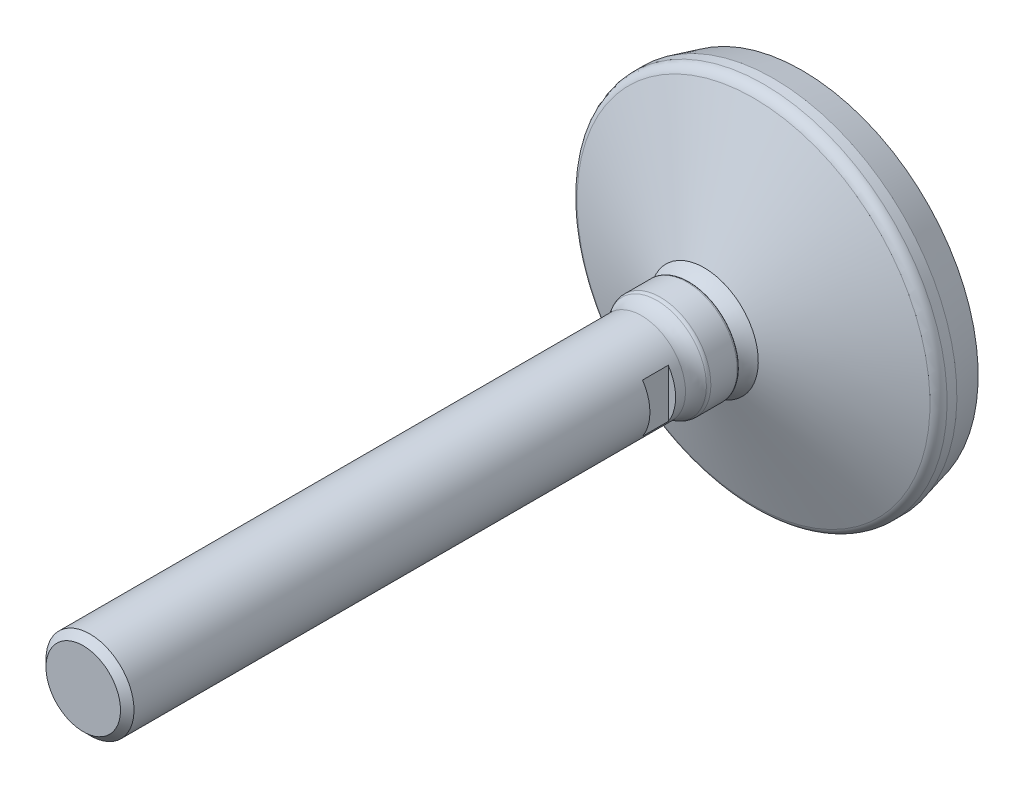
ISO-10303-21;
HEADER;
FILE_DESCRIPTION(('STEP AP214'),'2;1');
FILE_NAME('part.step','',(''),(''),'','','');
FILE_SCHEMA(('AUTOMOTIVE_DESIGN { 1 0 10303 214 1 1 1 1 }'));
ENDSEC;
DATA;
#1=APPLICATION_CONTEXT('core data for automotive mechanical design processes');
#2=APPLICATION_PROTOCOL_DEFINITION('international standard','automotive_design',2000,#1);
#3=PRODUCT_CONTEXT('',#1,'mechanical');
#4=PRODUCT('Part','Part','',(#3));
#5=PRODUCT_RELATED_PRODUCT_CATEGORY('part','',(#4));
#6=PRODUCT_DEFINITION_FORMATION('','',#4);
#7=PRODUCT_DEFINITION_CONTEXT('part definition',#1,'design');
#8=PRODUCT_DEFINITION('design','',#6,#7);
#9=PRODUCT_DEFINITION_SHAPE('','',#8);
#10=(LENGTH_UNIT() NAMED_UNIT(*) SI_UNIT(.MILLI.,.METRE.));
#11=(NAMED_UNIT(*) PLANE_ANGLE_UNIT() SI_UNIT($,.RADIAN.));
#12=(NAMED_UNIT(*) SI_UNIT($,.STERADIAN.) SOLID_ANGLE_UNIT());
#13=UNCERTAINTY_MEASURE_WITH_UNIT(LENGTH_MEASURE(1.E-05),#10,'distance_accuracy_value','');
#14=(GEOMETRIC_REPRESENTATION_CONTEXT(3) GLOBAL_UNCERTAINTY_ASSIGNED_CONTEXT((#13)) GLOBAL_UNIT_ASSIGNED_CONTEXT((#10,
#11,#12)) REPRESENTATION_CONTEXT('',''));
#15=CARTESIAN_POINT('',(0.,0.,0.));
#16=DIRECTION('',(0.,0.,1.));
#17=DIRECTION('',(1.,0.,0.));
#18=AXIS2_PLACEMENT_3D('',#15,#16,#17);
#19=CARTESIAN_POINT('',(0.,0.,35.3578436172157));
#20=DIRECTION('',(0.,0.,-1.));
#21=DIRECTION('',(0.,1.,0.));
#22=AXIS2_PLACEMENT_3D('',#19,#20,#21);
#23=TOROIDAL_SURFACE('',#22,23.0591361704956,12.);
#24=CARTESIAN_POINT('',(0.,0.,26.7));
#25=DIRECTION('',(0.,0.,-1.));
#26=DIRECTION('',(0.,1.,0.));
#27=AXIS2_PLACEMENT_3D('',#24,#25,#26);
#28=CIRCLE('',#27,14.75);
#29=CARTESIAN_POINT('',(0.,14.75,26.7));
#30=VERTEX_POINT('',#29);
#31=EDGE_CURVE('E86',#30,#30,#28,.T.);
#32=ORIENTED_EDGE('',*,*,#31,.F.);
#33=EDGE_LOOP('',(#32));
#34=FACE_BOUND('',#33,.T.);
#35=CARTESIAN_POINT('',(0.,0.,30.7));
#36=DIRECTION('',(0.,0.,-1.));
#37=DIRECTION('',(0.,1.,0.));
#38=AXIS2_PLACEMENT_3D('',#35,#36,#37);
#39=CIRCLE('',#38,12.);
#40=CARTESIAN_POINT('',(0.,12.,30.7));
#41=VERTEX_POINT('',#40);
#42=EDGE_CURVE('E61',#41,#41,#39,.T.);
#43=ORIENTED_EDGE('',*,*,#42,.T.);
#44=EDGE_LOOP('',(#43));
#45=FACE_BOUND('',#44,.T.);
#46=ADVANCED_FACE('F14',(#34,#45),#23,.F.);
#47=CARTESIAN_POINT('',(0.,0.,26.7));
#48=DIRECTION('',(0.,0.,-1.));
#49=DIRECTION('',(0.,1.,0.));
#50=AXIS2_PLACEMENT_3D('',#47,#48,#49);
#51=CONICAL_SURFACE('',#50,14.75,1.18784675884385);
#52=CARTESIAN_POINT('',(0.,0.,13.2569409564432));
#53=DIRECTION('',(0.,0.,-1.));
#54=DIRECTION('',(0.,1.,0.));
#55=AXIS2_PLACEMENT_3D('',#52,#53,#54);
#56=CIRCLE('',#55,48.1209740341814);
#57=CARTESIAN_POINT('',(0.,48.1209740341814,13.2569409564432));
#58=VERTEX_POINT('',#57);
#59=EDGE_CURVE('E89',#58,#58,#56,.T.);
#60=CARTESIAN_POINT('',(0.,48.1209740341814,13.2569409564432));
#61=CARTESIAN_POINT('',(0.,47.7733597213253,13.3969728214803));
#62=CARTESIAN_POINT('',(0.,47.4257454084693,13.5370046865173));
#63=CARTESIAN_POINT('',(0.,46.7305167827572,13.8170684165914));
#64=CARTESIAN_POINT('',(0.,46.3829024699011,13.9571002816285));
#65=CARTESIAN_POINT('',(0.,45.687673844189,14.2371640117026));
#66=CARTESIAN_POINT('',(0.,45.340059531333,14.3771958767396));
#67=CARTESIAN_POINT('',(0.,44.6448309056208,14.6572596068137));
#68=CARTESIAN_POINT('',(0.,44.2972165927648,14.7972914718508));
#69=CARTESIAN_POINT('',(0.,43.6019879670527,15.0773552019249));
#70=CARTESIAN_POINT('',(0.,43.2543736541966,15.2173870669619));
#71=CARTESIAN_POINT('',(0.,42.5591450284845,15.497450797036));
#72=CARTESIAN_POINT('',(0.,42.2115307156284,15.6374826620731));
#73=CARTESIAN_POINT('',(0.,41.5163020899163,15.9175463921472));
#74=CARTESIAN_POINT('',(0.,41.1686877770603,16.0575782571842));
#75=CARTESIAN_POINT('',(0.,40.4734591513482,16.3376419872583));
#76=CARTESIAN_POINT('',(0.,40.1258448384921,16.4776738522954));
#77=CARTESIAN_POINT('',(0.,39.43061621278,16.7577375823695));
#78=CARTESIAN_POINT('',(0.,39.0830018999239,16.8977694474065));
#79=CARTESIAN_POINT('',(0.,38.3877732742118,17.1778331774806));
#80=CARTESIAN_POINT('',(0.,38.0401589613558,17.3178650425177));
#81=CARTESIAN_POINT('',(0.,37.3449303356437,17.5979287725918));
#82=CARTESIAN_POINT('',(0.,36.9973160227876,17.7379606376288));
#83=CARTESIAN_POINT('',(0.,36.3020873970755,18.0180243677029));
#84=CARTESIAN_POINT('',(0.,35.9544730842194,18.15805623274));
#85=CARTESIAN_POINT('',(0.,35.2592444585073,18.4381199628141));
#86=CARTESIAN_POINT('',(0.,34.9116301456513,18.5781518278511));
#87=CARTESIAN_POINT('',(0.,34.2164015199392,18.8582155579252));
#88=CARTESIAN_POINT('',(0.,33.8687872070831,18.9982474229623));
#89=CARTESIAN_POINT('',(0.,33.173558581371,19.2783111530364));
#90=CARTESIAN_POINT('',(0.,32.8259442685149,19.4183430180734));
#91=CARTESIAN_POINT('',(0.,32.1307156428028,19.6984067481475));
#92=CARTESIAN_POINT('',(0.,31.7831013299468,19.8384386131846));
#93=CARTESIAN_POINT('',(0.,31.0878727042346,20.1185023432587));
#94=CARTESIAN_POINT('',(0.,30.7402583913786,20.2585342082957));
#95=CARTESIAN_POINT('',(0.,30.0450297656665,20.5385979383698));
#96=CARTESIAN_POINT('',(0.,29.6974154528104,20.6786298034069));
#97=CARTESIAN_POINT('',(0.,29.0021868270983,20.958693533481));
#98=CARTESIAN_POINT('',(0.,28.6545725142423,21.098725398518));
#99=CARTESIAN_POINT('',(0.,27.9593438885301,21.3787891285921));
#100=CARTESIAN_POINT('',(0.,27.6117295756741,21.5188209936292));
#101=CARTESIAN_POINT('',(0.,26.916500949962,21.7988847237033));
#102=CARTESIAN_POINT('',(0.,26.5688866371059,21.9389165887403));
#103=CARTESIAN_POINT('',(0.,25.8736580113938,22.2189803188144));
#104=CARTESIAN_POINT('',(0.,25.5260436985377,22.3590121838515));
#105=CARTESIAN_POINT('',(0.,24.8308150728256,22.6390759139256));
#106=CARTESIAN_POINT('',(0.,24.4832007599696,22.7791077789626));
#107=CARTESIAN_POINT('',(0.,23.7879721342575,23.0591715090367));
#108=CARTESIAN_POINT('',(0.,23.4403578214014,23.1992033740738));
#109=CARTESIAN_POINT('',(0.,22.7451291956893,23.4792671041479));
#110=CARTESIAN_POINT('',(0.,22.3975148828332,23.6192989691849));
#111=CARTESIAN_POINT('',(0.,21.7022862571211,23.899362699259));
#112=CARTESIAN_POINT('',(0.,21.3546719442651,24.0393945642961));
#113=CARTESIAN_POINT('',(0.,20.659443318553,24.3194582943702));
#114=CARTESIAN_POINT('',(0.,20.3118290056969,24.4594901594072));
#115=CARTESIAN_POINT('',(0.,19.6166003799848,24.7395538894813));
#116=CARTESIAN_POINT('',(0.,19.2689860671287,24.8795857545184));
#117=CARTESIAN_POINT('',(0.,18.5737574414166,25.1596494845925));
#118=CARTESIAN_POINT('',(0.,18.2261431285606,25.2996813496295));
#119=CARTESIAN_POINT('',(0.,17.5309145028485,25.5797450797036));
#120=CARTESIAN_POINT('',(0.,17.1833001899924,25.7197769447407));
#121=CARTESIAN_POINT('',(0.,16.4880715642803,25.9998406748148));
#122=CARTESIAN_POINT('',(0.,16.1404572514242,26.1398725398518));
#123=CARTESIAN_POINT('',(0.,15.4452286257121,26.4199362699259));
#124=CARTESIAN_POINT('',(0.,15.0976143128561,26.559968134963));
#125=CARTESIAN_POINT('',(0.,14.75,26.7));
#126=B_SPLINE_CURVE_WITH_KNOTS('',3,(#60,#61,#62,#63,#64,#65,#66,#67,#68,#69,#70,#71,#72,#73,
#74,#75,#76,#77,#78,#79,#80,#81,#82,#83,#84,#85,#86,#87,#88,#89,#90,#91,#92,#93,#94,#95,#96,#97,
#98,#99,#100,#101,#102,#103,#104,#105,#106,#107,#108,#109,#110,#111,#112,#113,#114,#115,#116,
#117,#118,#119,#120,#121,#122,#123,#124,#125),.UNSPECIFIED.,.F.,.F.,(4,2,2,2,2,2,2,2,2,2,2,2,2,
2,2,2,2,2,2,2,2,2,2,2,2,2,2,2,2,2,2,2,4),(0.,1.12427830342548,2.24855660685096,3.37283491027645,
4.49711321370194,5.62139151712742,6.7456698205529,7.86994812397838,8.99422642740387,
10.1185047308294,11.2427830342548,12.3670613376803,13.4913396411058,14.6156179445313,
15.7398962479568,16.8641745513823,17.9884528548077,19.1127311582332,20.2370094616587,
21.3612877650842,22.4855660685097,23.6098443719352,24.7341226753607,25.8584009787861,
26.9826792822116,28.1069575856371,29.2312358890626,30.3555141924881,31.4797924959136,
32.604070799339,33.7283491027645,34.85262740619,35.9769057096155),.UNSPECIFIED.);
#127=EDGE_CURVE('BSEAM147',#58,#30,#126,.T.);
#128=ORIENTED_EDGE('',*,*,#59,.F.);
#129=ORIENTED_EDGE('',*,*,#31,.T.);
#130=ORIENTED_EDGE('',*,*,#127,.T.);
#131=ORIENTED_EDGE('',*,*,#127,.F.);
#132=EDGE_LOOP('',(#128,#130,#129,#131));
#133=FACE_BOUND('',#132,.T.);
#134=ADVANCED_FACE('F147',(#133),#51,.T.);
#135=CARTESIAN_POINT('',(0.,0.,10.4742413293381));
#136=DIRECTION('',(0.,0.,-1.));
#137=DIRECTION('',(0.,1.,0.));
#138=AXIS2_PLACEMENT_3D('',#135,#136,#137);
#139=TOROIDAL_SURFACE('',#138,47.,3.);
#140=ORIENTED_EDGE('',*,*,#59,.T.);
#141=EDGE_LOOP('',(#140));
#142=FACE_BOUND('',#141,.T.);
#143=CARTESIAN_POINT('',(0.,0.,10.4742413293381));
#144=DIRECTION('',(0.,0.,-1.));
#145=DIRECTION('',(0.,1.,0.));
#146=AXIS2_PLACEMENT_3D('',#143,#144,#145);
#147=CIRCLE('',#146,50.);
#148=CARTESIAN_POINT('',(0.,50.,10.4742413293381));
#149=VERTEX_POINT('',#148);
#150=EDGE_CURVE('E92',#149,#149,#147,.T.);
#151=ORIENTED_EDGE('',*,*,#150,.F.);
#152=EDGE_LOOP('',(#151));
#153=FACE_BOUND('',#152,.T.);
#154=ADVANCED_FACE('F153',(#142,#153),#139,.T.);
#155=CARTESIAN_POINT('',(0.,0.,0.));
#156=DIRECTION('',(0.,0.,-1.));
#157=DIRECTION('',(0.,1.,0.));
#158=AXIS2_PLACEMENT_3D('',#155,#156,#157);
#159=CYLINDRICAL_SURFACE('',#158,50.);
#160=CARTESIAN_POINT('',(0.,0.,7.8));
#161=DIRECTION('',(0.,0.,-1.));
#162=DIRECTION('',(0.,1.,0.));
#163=AXIS2_PLACEMENT_3D('',#160,#161,#162);
#164=CIRCLE('',#163,50.);
#165=CARTESIAN_POINT('',(0.,50.,7.8));
#166=VERTEX_POINT('',#165);
#167=EDGE_CURVE('E95',#166,#166,#164,.T.);
#168=ORIENTED_EDGE('',*,*,#167,.F.);
#169=EDGE_LOOP('',(#168));
#170=FACE_BOUND('',#169,.T.);
#171=ORIENTED_EDGE('',*,*,#150,.T.);
#172=EDGE_LOOP('',(#171));
#173=FACE_BOUND('',#172,.T.);
#174=ADVANCED_FACE('F198',(#170,#173),#159,.T.);
#175=CARTESIAN_POINT('',(0.,0.,7.8));
#176=DIRECTION('',(0.,0.,1.));
#177=DIRECTION('',(0.,-1.,0.));
#178=AXIS2_PLACEMENT_3D('',#175,#176,#177);
#179=CONICAL_SURFACE('',#178,50.,0.251002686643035);
#180=CARTESIAN_POINT('',(0.,0.,0.));
#181=DIRECTION('',(0.,0.,-1.));
#182=DIRECTION('',(0.,1.,0.));
#183=AXIS2_PLACEMENT_3D('',#180,#181,#182);
#184=CIRCLE('',#183,48.);
#185=CARTESIAN_POINT('',(0.,48.,0.));
#186=VERTEX_POINT('',#185);
#187=EDGE_CURVE('E98',#186,#186,#184,.T.);
#188=ORIENTED_EDGE('',*,*,#187,.F.);
#189=EDGE_LOOP('',(#188));
#190=FACE_BOUND('',#189,.T.);
#191=ORIENTED_EDGE('',*,*,#167,.T.);
#192=EDGE_LOOP('',(#191));
#193=FACE_BOUND('',#192,.T.);
#194=ADVANCED_FACE('F194',(#190,#193),#179,.T.);
#195=CARTESIAN_POINT('',(48.,0.,0.));
#196=DIRECTION('',(0.,0.,1.));
#197=DIRECTION('',(0.,-1.,0.));
#198=AXIS2_PLACEMENT_3D('',#195,#196,#197);
#199=PLANE('',#198);
#200=ORIENTED_EDGE('',*,*,#187,.T.);
#201=EDGE_LOOP('',(#200));
#202=FACE_BOUND('',#201,.T.);
#203=ADVANCED_FACE('F187',(#202),#199,.F.);
#204=CARTESIAN_POINT('',(0.,0.,14.));
#205=DIRECTION('',(0.,0.,-1.));
#206=DIRECTION('',(0.,1.,0.));
#207=AXIS2_PLACEMENT_3D('',#204,#205,#206);
#208=CYLINDRICAL_SURFACE('',#207,12.);
#209=CARTESIAN_POINT('',(0.,0.,43.8));
#210=DIRECTION('',(0.,0.,-1.));
#211=DIRECTION('',(0.,1.,0.));
#212=AXIS2_PLACEMENT_3D('',#209,#210,#211);
#213=CIRCLE('',#212,12.);
#214=CARTESIAN_POINT('',(0.,12.,43.8));
#215=VERTEX_POINT('',#214);
#216=EDGE_CURVE('E107',#215,#215,#213,.T.);
#217=ORIENTED_EDGE('',*,*,#216,.F.);
#218=EDGE_LOOP('',(#217));
#219=FACE_BOUND('',#218,.T.);
#220=DIRECTION('',(0.,0.,-1.));
#221=VECTOR('',#220,1.);
#222=CARTESIAN_POINT('',(10.,-6.6332495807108,14.));
#223=LINE('',#222,#221);
#224=CARTESIAN_POINT('',(10.,-6.6332495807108,46.5));
#225=VERTEX_POINT('',#224);
#226=CARTESIAN_POINT('',(10.,-6.6332495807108,53.5));
#227=VERTEX_POINT('',#226);
#228=EDGE_CURVE('E77',#225,#227,#223,.F.);
#229=ORIENTED_EDGE('',*,*,#228,.T.);
#230=CARTESIAN_POINT('',(0.,0.,53.5));
#231=DIRECTION('',(0.,0.,1.));
#232=DIRECTION('',(0.,-1.,0.));
#233=AXIS2_PLACEMENT_3D('',#230,#231,#232);
#234=CIRCLE('',#233,12.);
#235=CARTESIAN_POINT('',(10.,6.6332495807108,53.5));
#236=VERTEX_POINT('',#235);
#237=EDGE_CURVE('E9',#227,#236,#234,.T.);
#238=ORIENTED_EDGE('',*,*,#237,.T.);
#239=DIRECTION('',(0.,0.,-1.));
#240=VECTOR('',#239,1.);
#241=CARTESIAN_POINT('',(10.,6.6332495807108,14.));
#242=LINE('',#241,#240);
#243=CARTESIAN_POINT('',(10.,6.6332495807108,46.5));
#244=VERTEX_POINT('',#243);
#245=EDGE_CURVE('E17',#236,#244,#242,.T.);
#246=ORIENTED_EDGE('',*,*,#245,.T.);
#247=CARTESIAN_POINT('',(0.,0.,46.5));
#248=DIRECTION('',(0.,0.,1.));
#249=DIRECTION('',(0.,-1.,0.));
#250=AXIS2_PLACEMENT_3D('',#247,#248,#249);
#251=CIRCLE('',#250,12.);
#252=EDGE_CURVE('E63',#225,#244,#251,.T.);
#253=ORIENTED_EDGE('',*,*,#252,.F.);
#254=EDGE_LOOP('',(#229,#238,#246,#253));
#255=FACE_BOUND('',#254,.T.);
#256=DIRECTION('',(0.,0.,-1.));
#257=VECTOR('',#256,1.);
#258=CARTESIAN_POINT('',(-10.,6.6332495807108,14.));
#259=LINE('',#258,#257);
#260=CARTESIAN_POINT('',(-10.,6.6332495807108,46.5));
#261=VERTEX_POINT('',#260);
#262=CARTESIAN_POINT('',(-10.,6.6332495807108,53.5));
#263=VERTEX_POINT('',#262);
#264=EDGE_CURVE('E60',#261,#263,#259,.F.);
#265=ORIENTED_EDGE('',*,*,#264,.T.);
#266=CARTESIAN_POINT('',(-10.,-6.6332495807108,53.5));
#267=VERTEX_POINT('',#266);
#268=EDGE_CURVE('E23',#263,#267,#234,.T.);
#269=ORIENTED_EDGE('',*,*,#268,.T.);
#270=DIRECTION('',(0.,0.,-1.));
#271=VECTOR('',#270,1.);
#272=CARTESIAN_POINT('',(-10.,-6.6332495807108,14.));
#273=LINE('',#272,#271);
#274=CARTESIAN_POINT('',(-10.,-6.6332495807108,46.5));
#275=VERTEX_POINT('',#274);
#276=EDGE_CURVE('E67',#267,#275,#273,.T.);
#277=ORIENTED_EDGE('',*,*,#276,.T.);
#278=EDGE_CURVE('E55',#261,#275,#251,.T.);
#279=ORIENTED_EDGE('',*,*,#278,.F.);
#280=EDGE_LOOP('',(#265,#269,#277,#279));
#281=FACE_BOUND('',#280,.T.);
#282=CARTESIAN_POINT('',(0.,0.,194.1595));
#283=DIRECTION('',(0.,0.,-1.));
#284=DIRECTION('',(0.,1.,0.));
#285=AXIS2_PLACEMENT_3D('',#282,#283,#284);
#286=CIRCLE('',#285,12.);
#287=CARTESIAN_POINT('',(0.,12.,194.1595));
#288=VERTEX_POINT('',#287);
#289=EDGE_CURVE('E104',#288,#288,#286,.T.);
#290=ORIENTED_EDGE('',*,*,#289,.T.);
#291=EDGE_LOOP('',(#290));
#292=FACE_BOUND('',#291,.T.);
#293=ADVANCED_FACE('F73',(#219,#255,#281,#292),#208,.T.);
#294=CARTESIAN_POINT('',(0.,0.,43.8));
#295=DIRECTION('',(0.,0.,-1.));
#296=DIRECTION('',(0.,1.,0.));
#297=AXIS2_PLACEMENT_3D('',#294,#295,#296);
#298=TOROIDAL_SURFACE('',#297,19.,7.);
#299=CARTESIAN_POINT('',(0.,0.,39.5456515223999));
#300=DIRECTION('',(0.,0.,-1.));
#301=DIRECTION('',(0.,1.,0.));
#302=AXIS2_PLACEMENT_3D('',#299,#300,#301);
#303=CIRCLE('',#302,13.4411764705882);
#304=CARTESIAN_POINT('',(0.,13.4411764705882,39.5456515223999));
#305=VERTEX_POINT('',#304);
#306=EDGE_CURVE('E110',#305,#305,#303,.T.);
#307=ORIENTED_EDGE('',*,*,#306,.F.);
#308=EDGE_LOOP('',(#307));
#309=FACE_BOUND('',#308,.T.);
#310=ORIENTED_EDGE('',*,*,#216,.T.);
#311=EDGE_LOOP('',(#310));
#312=FACE_BOUND('',#311,.T.);
#313=ADVANCED_FACE('F180',(#309,#312),#298,.F.);
#314=CARTESIAN_POINT('',(0.,0.,38.6340054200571));
#315=DIRECTION('',(0.,0.,-1.));
#316=DIRECTION('',(0.,1.,0.));
#317=AXIS2_PLACEMENT_3D('',#314,#315,#316);
#318=TOROIDAL_SURFACE('',#317,12.25,1.49999999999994);
#319=ORIENTED_EDGE('',*,*,#306,.T.);
#320=EDGE_LOOP('',(#319));
#321=FACE_BOUND('',#320,.T.);
#322=CARTESIAN_POINT('',(0.,0.,38.6340054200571));
#323=DIRECTION('',(0.,0.,-1.));
#324=DIRECTION('',(0.,1.,0.));
#325=AXIS2_PLACEMENT_3D('',#322,#323,#324);
#326=CIRCLE('',#325,13.75);
#327=CARTESIAN_POINT('',(0.,13.75,38.6340054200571));
#328=VERTEX_POINT('',#327);
#329=EDGE_CURVE('E113',#328,#328,#326,.T.);
#330=ORIENTED_EDGE('',*,*,#329,.F.);
#331=EDGE_LOOP('',(#330));
#332=FACE_BOUND('',#331,.T.);
#333=ADVANCED_FACE('F173',(#321,#332),#318,.T.);
#334=CARTESIAN_POINT('',(0.,0.,14.));
#335=DIRECTION('',(0.,0.,-1.));
#336=DIRECTION('',(0.,1.,0.));
#337=AXIS2_PLACEMENT_3D('',#334,#335,#336);
#338=CYLINDRICAL_SURFACE('',#337,13.75);
#339=CARTESIAN_POINT('',(0.,0.,31.45));
#340=DIRECTION('',(0.,0.,-1.));
#341=DIRECTION('',(0.,1.,0.));
#342=AXIS2_PLACEMENT_3D('',#339,#340,#341);
#343=CIRCLE('',#342,13.75);
#344=CARTESIAN_POINT('',(0.,13.75,31.45));
#345=VERTEX_POINT('',#344);
#346=EDGE_CURVE('E116',#345,#345,#343,.T.);
#347=ORIENTED_EDGE('',*,*,#346,.F.);
#348=EDGE_LOOP('',(#347));
#349=FACE_BOUND('',#348,.T.);
#350=ORIENTED_EDGE('',*,*,#329,.T.);
#351=EDGE_LOOP('',(#350));
#352=FACE_BOUND('',#351,.T.);
#353=ADVANCED_FACE('F166',(#349,#352),#338,.T.);
#354=CARTESIAN_POINT('',(0.,0.,31.45));
#355=DIRECTION('',(0.,0.,-1.));
#356=DIRECTION('',(0.,1.,0.));
#357=AXIS2_PLACEMENT_3D('',#354,#355,#356);
#358=TOROIDAL_SURFACE('',#357,13.,0.75);
#359=ORIENTED_EDGE('',*,*,#346,.T.);
#360=EDGE_LOOP('',(#359));
#361=FACE_BOUND('',#360,.T.);
#362=CARTESIAN_POINT('',(0.,0.,30.7));
#363=DIRECTION('',(0.,0.,-1.));
#364=DIRECTION('',(0.,1.,0.));
#365=AXIS2_PLACEMENT_3D('',#362,#363,#364);
#366=CIRCLE('',#365,13.);
#367=CARTESIAN_POINT('',(0.,13.,30.7));
#368=VERTEX_POINT('',#367);
#369=EDGE_CURVE('E119',#368,#368,#366,.T.);
#370=ORIENTED_EDGE('',*,*,#369,.F.);
#371=EDGE_LOOP('',(#370));
#372=FACE_BOUND('',#371,.T.);
#373=ADVANCED_FACE('F161',(#361,#372),#358,.T.);
#374=CARTESIAN_POINT('',(13.,0.,30.7));
#375=DIRECTION('',(0.,0.,1.));
#376=DIRECTION('',(0.,-1.,0.));
#377=AXIS2_PLACEMENT_3D('',#374,#375,#376);
#378=PLANE('',#377);
#379=ORIENTED_EDGE('',*,*,#42,.F.);
#380=EDGE_LOOP('',(#379));
#381=FACE_BOUND('',#380,.T.);
#382=ORIENTED_EDGE('',*,*,#369,.T.);
#383=EDGE_LOOP('',(#382));
#384=FACE_BOUND('',#383,.T.);
#385=ADVANCED_FACE('F145',(#381,#384),#378,.F.);
#386=CARTESIAN_POINT('',(0.,0.,46.5));
#387=DIRECTION('',(0.,0.,1.));
#388=DIRECTION('',(0.,-1.,0.));
#389=AXIS2_PLACEMENT_3D('',#386,#387,#388);
#390=PLANE('',#389);
#391=ORIENTED_EDGE('',*,*,#278,.T.);
#392=DIRECTION('',(0.,-1.,0.));
#393=VECTOR('',#392,1.);
#394=CARTESIAN_POINT('',(-10.,24.,46.5));
#395=LINE('',#394,#393);
#396=EDGE_CURVE('E29',#261,#275,#395,.T.);
#397=ORIENTED_EDGE('',*,*,#396,.F.);
#398=EDGE_LOOP('',(#391,#397));
#399=FACE_BOUND('',#398,.T.);
#400=ADVANCED_FACE('F56',(#399),#390,.T.);
#401=CARTESIAN_POINT('',(0.,0.,53.5));
#402=DIRECTION('',(0.,0.,1.));
#403=DIRECTION('',(0.,-1.,0.));
#404=AXIS2_PLACEMENT_3D('',#401,#402,#403);
#405=PLANE('',#404);
#406=DIRECTION('',(0.,-1.,0.));
#407=VECTOR('',#406,1.);
#408=CARTESIAN_POINT('',(-10.,24.,53.5));
#409=LINE('',#408,#407);
#410=EDGE_CURVE('E121',#263,#267,#409,.T.);
#411=ORIENTED_EDGE('',*,*,#410,.T.);
#412=ORIENTED_EDGE('',*,*,#268,.F.);
#413=EDGE_LOOP('',(#411,#412));
#414=FACE_BOUND('',#413,.T.);
#415=ADVANCED_FACE('F142',(#414),#405,.F.);
#416=CARTESIAN_POINT('',(-10.,24.,53.5));
#417=DIRECTION('',(1.,0.,0.));
#418=DIRECTION('',(0.,1.,0.));
#419=AXIS2_PLACEMENT_3D('',#416,#417,#418);
#420=PLANE('',#419);
#421=ORIENTED_EDGE('',*,*,#410,.F.);
#422=ORIENTED_EDGE('',*,*,#264,.F.);
#423=ORIENTED_EDGE('',*,*,#396,.T.);
#424=ORIENTED_EDGE('',*,*,#276,.F.);
#425=EDGE_LOOP('',(#421,#422,#423,#424));
#426=FACE_BOUND('',#425,.T.);
#427=ADVANCED_FACE('F66',(#426),#420,.F.);
#428=CARTESIAN_POINT('',(10.,-24.,53.5));
#429=DIRECTION('',(-1.,0.,0.));
#430=DIRECTION('',(0.,-1.,0.));
#431=AXIS2_PLACEMENT_3D('',#428,#429,#430);
#432=PLANE('',#431);
#433=DIRECTION('',(0.,1.,0.));
#434=VECTOR('',#433,1.);
#435=CARTESIAN_POINT('',(10.,-24.,53.5));
#436=LINE('',#435,#434);
#437=EDGE_CURVE('E69',#227,#236,#436,.T.);
#438=ORIENTED_EDGE('',*,*,#437,.F.);
#439=ORIENTED_EDGE('',*,*,#228,.F.);
#440=DIRECTION('',(0.,1.,0.));
#441=VECTOR('',#440,1.);
#442=CARTESIAN_POINT('',(10.,-24.,46.5));
#443=LINE('',#442,#441);
#444=EDGE_CURVE('E70',#225,#244,#443,.T.);
#445=ORIENTED_EDGE('',*,*,#444,.T.);
#446=ORIENTED_EDGE('',*,*,#245,.F.);
#447=EDGE_LOOP('',(#438,#439,#445,#446));
#448=FACE_BOUND('',#447,.T.);
#449=ADVANCED_FACE('F127',(#448),#432,.F.);
#450=ORIENTED_EDGE('',*,*,#437,.T.);
#451=ORIENTED_EDGE('',*,*,#237,.F.);
#452=EDGE_LOOP('',(#450,#451));
#453=FACE_BOUND('',#452,.T.);
#454=ADVANCED_FACE('F126',(#453),#405,.F.);
#455=ORIENTED_EDGE('',*,*,#444,.F.);
#456=ORIENTED_EDGE('',*,*,#252,.T.);
#457=EDGE_LOOP('',(#455,#456));
#458=FACE_BOUND('',#457,.T.);
#459=ADVANCED_FACE('F128',(#458),#390,.T.);
#460=CARTESIAN_POINT('',(0.,0.,196.));
#461=DIRECTION('',(0.,0.,-1.));
#462=DIRECTION('',(0.,1.,0.));
#463=AXIS2_PLACEMENT_3D('',#460,#461,#462);
#464=PLANE('',#463);
#465=CARTESIAN_POINT('',(0.,0.,196.));
#466=DIRECTION('',(0.,0.,-1.));
#467=DIRECTION('',(0.,1.,0.));
#468=AXIS2_PLACEMENT_3D('',#465,#466,#467);
#469=CIRCLE('',#468,10.1595);
#470=CARTESIAN_POINT('',(0.,10.1595,196.));
#471=VERTEX_POINT('',#470);
#472=EDGE_CURVE('E101',#471,#471,#469,.T.);
#473=ORIENTED_EDGE('',*,*,#472,.F.);
#474=EDGE_LOOP('',(#473));
#475=FACE_BOUND('',#474,.T.);
#476=ADVANCED_FACE('F130',(#475),#464,.F.);
#477=CARTESIAN_POINT('',(0.,0.,196.));
#478=DIRECTION('',(0.,0.,-1.));
#479=DIRECTION('',(0.,1.,0.));
#480=AXIS2_PLACEMENT_3D('',#477,#478,#479);
#481=CONICAL_SURFACE('',#480,10.1595,0.78539816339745);
#482=ORIENTED_EDGE('',*,*,#289,.F.);
#483=EDGE_LOOP('',(#482));
#484=FACE_BOUND('',#483,.T.);
#485=ORIENTED_EDGE('',*,*,#472,.T.);
#486=EDGE_LOOP('',(#485));
#487=FACE_BOUND('',#486,.T.);
#488=ADVANCED_FACE('F138',(#484,#487),#481,.T.);
#489=CLOSED_SHELL('',(#46,#134,#154,#174,#194,#203,#293,#313,#333,#353,#373,#385,#400,#415,#427,
#449,#454,#459,#476,#488));
#490=MANIFOLD_SOLID_BREP('B1',#489);
#491=ADVANCED_BREP_SHAPE_REPRESENTATION('',(#18,#490),#14);
#492=SHAPE_DEFINITION_REPRESENTATION(#9,#491);
ENDSEC;
END-ISO-10303-21;
